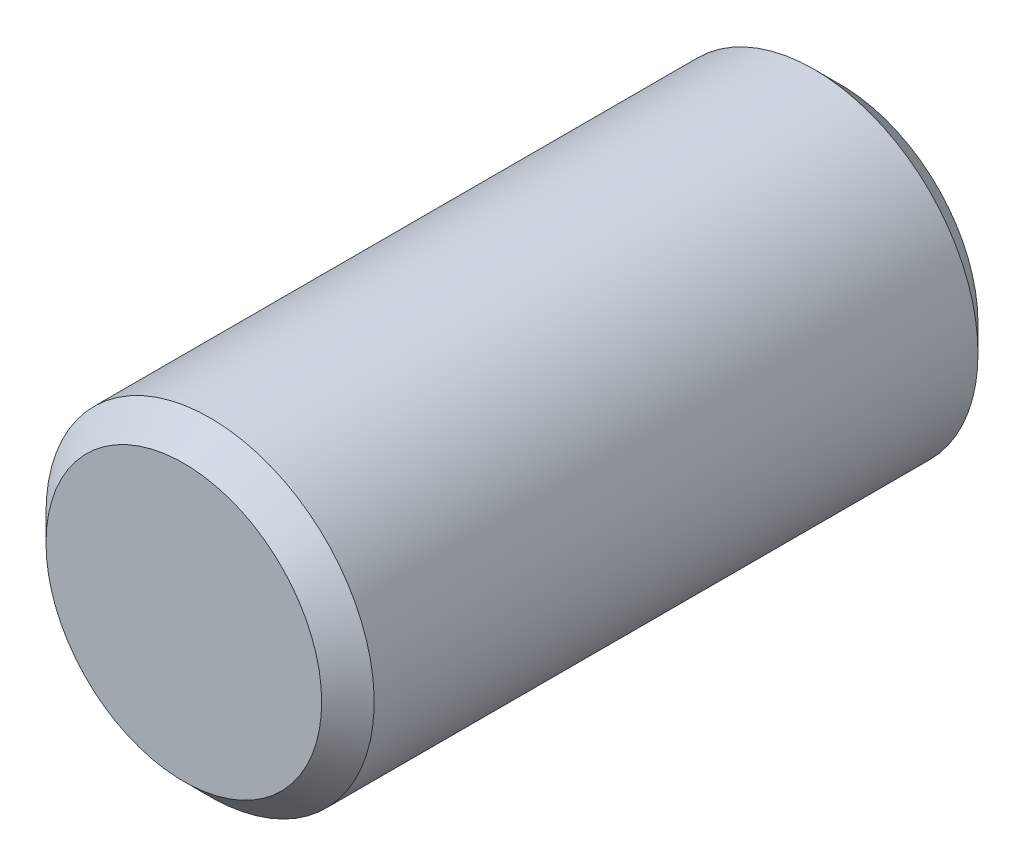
from build123d import *

# Parameters (mm, degrees)
ESQUISSE1_R      = 1.25
EXTRUSION1_DEPTH = 5
CHANFREIN1_SIZE  = 0.2


with BuildPart() as part:
    # Esquisse1 → Extrusion1 (new body)
    with BuildSketch(Plane.XY):
        Circle(ESQUISSE1_R)
    extrude(amount=EXTRUSION1_DEPTH)

    # Chanfrein1
    chanfrein1_edges = [part.edges().sort_by_distance(p)[0] for p in [
        (-1.25, 0, 0),
        (-1.25, 0, 5),
    ]]
    chamfer(chanfrein1_edges, length=CHANFREIN1_SIZE)


solid = part.part
